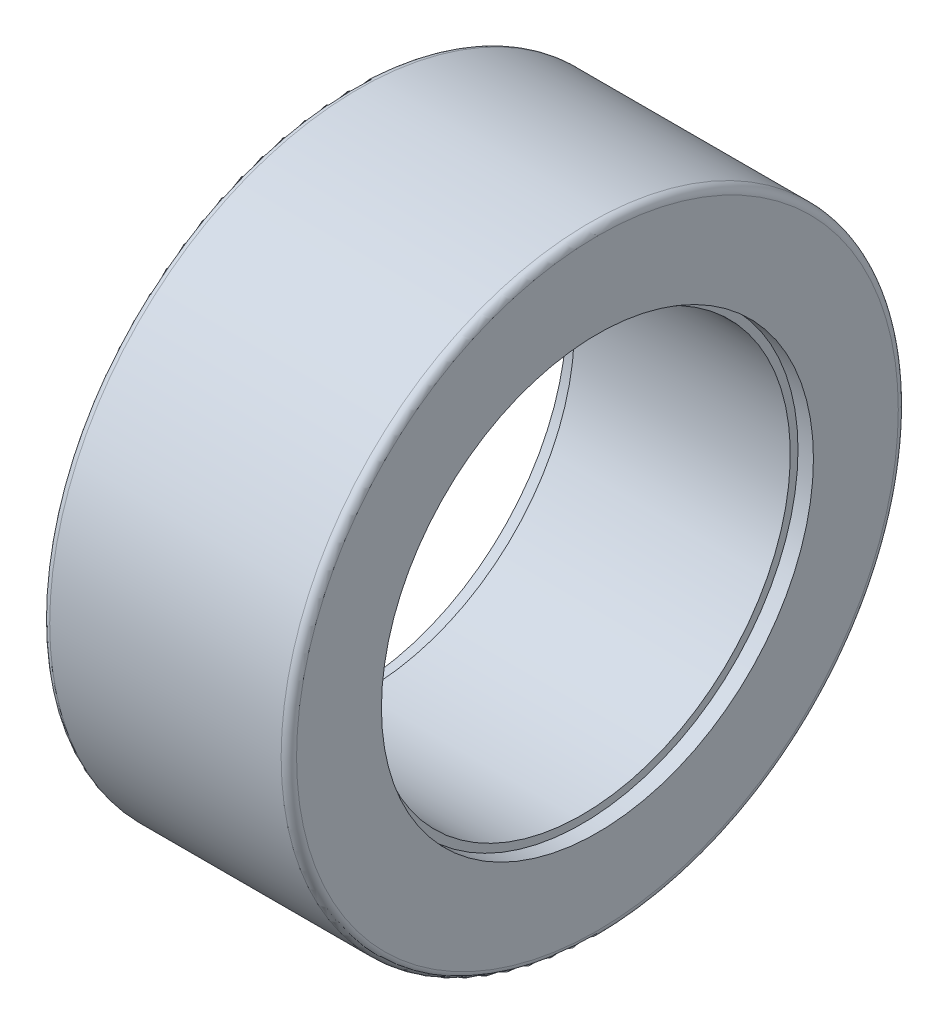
from build123d import *


with BuildPart() as part:
    # Sketch1 → Revolve1 (revolve)
    with BuildSketch(Plane.XY, mode=Mode.PRIVATE) as revolve1_sk:
        with BuildLine():
            Line((-15, 40), (15, 40))
            ThreePointArc((15, 40), (15.707106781, 39.707106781), (16, 39))
            Line((16, 39), (16, 28))
            Line((16, 28), (14, 28))
            Line((14, 28), (14, 27))
            Line((14, 27), (-14, 27))
            Line((-14, 27), (-14, 28))
            Line((-14, 28), (-16, 28))
            Line((-16, 28), (-16, 39))
            ThreePointArc((-16, 39), (-15.707106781, 39.707106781), (-15, 40))
        make_face()
    revolve(revolve1_sk.sketch.rotate(Axis((-79.557359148, 0, 0), (1, 0, 0)), 90), axis=Axis((-79.557359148, 0, 0), (1, 0, 0)))


solid = part.part
